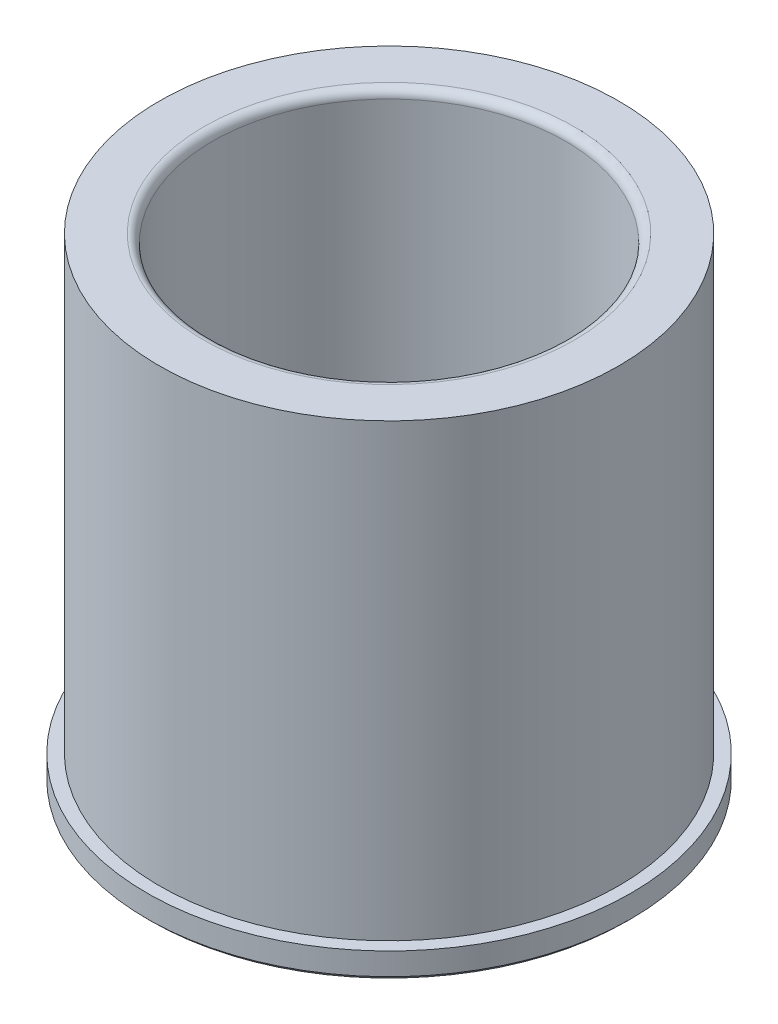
ISO-10303-21;
HEADER;
FILE_DESCRIPTION(('STEP AP214'),'2;1');
FILE_NAME('part.step','',(''),(''),'','','');
FILE_SCHEMA(('AUTOMOTIVE_DESIGN { 1 0 10303 214 1 1 1 1 }'));
ENDSEC;
DATA;
#1=APPLICATION_CONTEXT('core data for automotive mechanical design processes');
#2=APPLICATION_PROTOCOL_DEFINITION('international standard','automotive_design',2000,#1);
#3=PRODUCT_CONTEXT('',#1,'mechanical');
#4=PRODUCT('Part','Part','',(#3));
#5=PRODUCT_RELATED_PRODUCT_CATEGORY('part','',(#4));
#6=PRODUCT_DEFINITION_FORMATION('','',#4);
#7=PRODUCT_DEFINITION_CONTEXT('part definition',#1,'design');
#8=PRODUCT_DEFINITION('design','',#6,#7);
#9=PRODUCT_DEFINITION_SHAPE('','',#8);
#10=(LENGTH_UNIT() NAMED_UNIT(*) SI_UNIT(.MILLI.,.METRE.));
#11=(NAMED_UNIT(*) PLANE_ANGLE_UNIT() SI_UNIT($,.RADIAN.));
#12=(NAMED_UNIT(*) SI_UNIT($,.STERADIAN.) SOLID_ANGLE_UNIT());
#13=UNCERTAINTY_MEASURE_WITH_UNIT(LENGTH_MEASURE(1.E-05),#10,'distance_accuracy_value','');
#14=(GEOMETRIC_REPRESENTATION_CONTEXT(3) GLOBAL_UNCERTAINTY_ASSIGNED_CONTEXT((#13)) GLOBAL_UNIT_ASSIGNED_CONTEXT((#10,
#11,#12)) REPRESENTATION_CONTEXT('',''));
#15=CARTESIAN_POINT('',(0.,0.,0.));
#16=DIRECTION('',(0.,0.,1.));
#17=DIRECTION('',(1.,0.,0.));
#18=AXIS2_PLACEMENT_3D('',#15,#16,#17);
#19=CARTESIAN_POINT('',(3.49148336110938E-12,-1000.,0.));
#20=DIRECTION('',(0.,-1.,0.));
#21=DIRECTION('',(1.,0.,0.));
#22=AXIS2_PLACEMENT_3D('',#19,#20,#21);
#23=CYLINDRICAL_SURFACE('',#22,41.2813499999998);
#24=CARTESIAN_POINT('',(0.,4.76250000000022,0.));
#25=DIRECTION('',(0.,-1.,0.));
#26=DIRECTION('',(1.,0.,0.));
#27=AXIS2_PLACEMENT_3D('',#24,#25,#26);
#28=CIRCLE('',#27,41.28135);
#29=CARTESIAN_POINT('',(41.2813499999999,4.76250000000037,0.));
#30=VERTEX_POINT('',#29);
#31=EDGE_CURVE('E60',#30,#30,#28,.T.);
#32=ORIENTED_EDGE('',*,*,#31,.F.);
#33=EDGE_LOOP('',(#32));
#34=FACE_BOUND('',#33,.T.);
#35=CARTESIAN_POINT('',(-2.99307411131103E-13,85.7250000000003,0.));
#36=DIRECTION('',(0.,-1.,0.));
#37=DIRECTION('',(1.,0.,0.));
#38=AXIS2_PLACEMENT_3D('',#35,#36,#37);
#39=CIRCLE('',#38,41.2813499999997);
#40=CARTESIAN_POINT('',(41.2813499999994,85.7250000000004,0.));
#41=VERTEX_POINT('',#40);
#42=EDGE_CURVE('E39',#41,#41,#39,.T.);
#43=ORIENTED_EDGE('',*,*,#42,.T.);
#44=EDGE_LOOP('',(#43));
#45=FACE_BOUND('',#44,.T.);
#46=ADVANCED_FACE('F28',(#34,#45),#23,.T.);
#47=CARTESIAN_POINT('',(-41.28135,85.725,0.));
#48=DIRECTION('',(0.,-1.,0.));
#49=DIRECTION('',(1.,0.,0.));
#50=AXIS2_PLACEMENT_3D('',#47,#48,#49);
#51=PLANE('',#50);
#52=CARTESIAN_POINT('',(-2.99307411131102E-13,85.7250000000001,0.));
#53=DIRECTION('',(0.,-1.,0.));
#54=DIRECTION('',(1.,0.,0.));
#55=AXIS2_PLACEMENT_3D('',#52,#53,#54);
#56=CIRCLE('',#55,33.2803499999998);
#57=CARTESIAN_POINT('',(33.2803499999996,85.7250000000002,0.));
#58=VERTEX_POINT('',#57);
#59=EDGE_CURVE('E35',#58,#58,#56,.T.);
#60=ORIENTED_EDGE('',*,*,#59,.T.);
#61=EDGE_LOOP('',(#60));
#62=FACE_BOUND('',#61,.T.);
#63=ORIENTED_EDGE('',*,*,#42,.F.);
#64=EDGE_LOOP('',(#63));
#65=FACE_BOUND('',#64,.T.);
#66=ADVANCED_FACE('F68',(#62,#65),#51,.F.);
#67=CARTESIAN_POINT('',(3.49148336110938E-12,-1000.,0.));
#68=DIRECTION('',(0.,-1.,0.));
#69=DIRECTION('',(1.,0.,0.));
#70=AXIS2_PLACEMENT_3D('',#67,#68,#69);
#71=CYLINDRICAL_SURFACE('',#70,31.7563499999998);
#72=CARTESIAN_POINT('',(-2.93986390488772E-13,84.2010000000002,0.));
#73=DIRECTION('',(0.,-1.,0.));
#74=DIRECTION('',(1.,0.,0.));
#75=AXIS2_PLACEMENT_3D('',#72,#73,#74);
#76=CIRCLE('',#75,31.7563499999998);
#77=CARTESIAN_POINT('',(31.7563499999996,84.2010000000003,0.));
#78=VERTEX_POINT('',#77);
#79=EDGE_CURVE('E10',#78,#78,#76,.F.);
#80=ORIENTED_EDGE('',*,*,#79,.T.);
#81=EDGE_LOOP('',(#80));
#82=FACE_BOUND('',#81,.T.);
#83=CARTESIAN_POINT('',(0.,0.761999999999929,0.));
#84=DIRECTION('',(0.,-1.,0.));
#85=DIRECTION('',(1.,0.,0.));
#86=AXIS2_PLACEMENT_3D('',#83,#84,#85);
#87=CIRCLE('',#86,31.75635);
#88=CARTESIAN_POINT('',(31.75635,0.76200000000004,0.));
#89=VERTEX_POINT('',#88);
#90=EDGE_CURVE('E43',#89,#89,#87,.T.);
#91=ORIENTED_EDGE('',*,*,#90,.T.);
#92=EDGE_LOOP('',(#91));
#93=FACE_BOUND('',#92,.T.);
#94=ADVANCED_FACE('F72',(#82,#93),#71,.F.);
#95=CARTESIAN_POINT('',(0.,2.22044604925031E-13,0.));
#96=DIRECTION('',(0.,-1.,0.));
#97=DIRECTION('',(1.,0.,0.));
#98=AXIS2_PLACEMENT_3D('',#95,#96,#97);
#99=CONICAL_SURFACE('',#98,32.51835,0.78539816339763);
#100=ORIENTED_EDGE('',*,*,#90,.F.);
#101=EDGE_LOOP('',(#100));
#102=FACE_BOUND('',#101,.T.);
#103=CARTESIAN_POINT('',(0.,2.22044604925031E-13,0.));
#104=DIRECTION('',(0.,-1.,0.));
#105=DIRECTION('',(1.,0.,0.));
#106=AXIS2_PLACEMENT_3D('',#103,#104,#105);
#107=CIRCLE('',#106,32.51835);
#108=CARTESIAN_POINT('',(32.51835,3.35581882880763E-13,0.));
#109=VERTEX_POINT('',#108);
#110=EDGE_CURVE('E48',#109,#109,#107,.T.);
#111=ORIENTED_EDGE('',*,*,#110,.T.);
#112=EDGE_LOOP('',(#111));
#113=FACE_BOUND('',#112,.T.);
#114=ADVANCED_FACE('F77',(#102,#113),#99,.F.);
#115=CARTESIAN_POINT('',(-32.51835,0.,0.));
#116=DIRECTION('',(0.,1.,0.));
#117=DIRECTION('',(-1.,0.,0.));
#118=AXIS2_PLACEMENT_3D('',#115,#116,#117);
#119=PLANE('',#118);
#120=ORIENTED_EDGE('',*,*,#110,.F.);
#121=EDGE_LOOP('',(#120));
#122=FACE_BOUND('',#121,.T.);
#123=CARTESIAN_POINT('',(0.,2.22044604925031E-13,0.));
#124=DIRECTION('',(0.,-1.,0.));
#125=DIRECTION('',(1.,0.,0.));
#126=AXIS2_PLACEMENT_3D('',#123,#124,#125);
#127=CIRCLE('',#126,42.7609);
#128=CARTESIAN_POINT('',(42.7609,3.71343575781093E-13,0.));
#129=VERTEX_POINT('',#128);
#130=EDGE_CURVE('E51',#129,#129,#127,.T.);
#131=ORIENTED_EDGE('',*,*,#130,.T.);
#132=EDGE_LOOP('',(#131));
#133=FACE_BOUND('',#132,.T.);
#134=ADVANCED_FACE('F82',(#122,#133),#119,.F.);
#135=CARTESIAN_POINT('',(0.,0.762000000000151,0.));
#136=DIRECTION('',(0.,1.,0.));
#137=DIRECTION('',(-1.,0.,0.));
#138=AXIS2_PLACEMENT_3D('',#135,#136,#137);
#139=CONICAL_SURFACE('',#138,43.5229,0.785398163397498);
#140=ORIENTED_EDGE('',*,*,#130,.F.);
#141=EDGE_LOOP('',(#140));
#142=FACE_BOUND('',#141,.T.);
#143=CARTESIAN_POINT('',(0.,0.762000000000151,0.));
#144=DIRECTION('',(0.,-1.,0.));
#145=DIRECTION('',(1.,0.,0.));
#146=AXIS2_PLACEMENT_3D('',#143,#144,#145);
#147=CIRCLE('',#146,43.5229);
#148=CARTESIAN_POINT('',(43.5229,0.762000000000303,0.));
#149=VERTEX_POINT('',#148);
#150=EDGE_CURVE('E54',#149,#149,#147,.T.);
#151=ORIENTED_EDGE('',*,*,#150,.T.);
#152=EDGE_LOOP('',(#151));
#153=FACE_BOUND('',#152,.T.);
#154=ADVANCED_FACE('F86',(#142,#153),#139,.T.);
#155=CARTESIAN_POINT('',(3.49148336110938E-12,-1000.,0.));
#156=DIRECTION('',(0.,-1.,0.));
#157=DIRECTION('',(1.,0.,0.));
#158=AXIS2_PLACEMENT_3D('',#155,#156,#157);
#159=CYLINDRICAL_SURFACE('',#158,43.5229);
#160=ORIENTED_EDGE('',*,*,#150,.F.);
#161=EDGE_LOOP('',(#160));
#162=FACE_BOUND('',#161,.T.);
#163=CARTESIAN_POINT('',(0.,4.76250000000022,0.));
#164=DIRECTION('',(0.,-1.,0.));
#165=DIRECTION('',(1.,0.,0.));
#166=AXIS2_PLACEMENT_3D('',#163,#164,#165);
#167=CIRCLE('',#166,43.5229);
#168=CARTESIAN_POINT('',(43.5229,4.76250000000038,0.));
#169=VERTEX_POINT('',#168);
#170=EDGE_CURVE('E57',#169,#169,#167,.T.);
#171=ORIENTED_EDGE('',*,*,#170,.T.);
#172=EDGE_LOOP('',(#171));
#173=FACE_BOUND('',#172,.T.);
#174=ADVANCED_FACE('F90',(#162,#173),#159,.T.);
#175=CARTESIAN_POINT('',(-43.5229,4.76249999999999,0.));
#176=DIRECTION('',(0.,-1.,0.));
#177=DIRECTION('',(1.,0.,0.));
#178=AXIS2_PLACEMENT_3D('',#175,#176,#177);
#179=PLANE('',#178);
#180=ORIENTED_EDGE('',*,*,#170,.F.);
#181=EDGE_LOOP('',(#180));
#182=FACE_BOUND('',#181,.T.);
#183=ORIENTED_EDGE('',*,*,#31,.T.);
#184=EDGE_LOOP('',(#183));
#185=FACE_BOUND('',#184,.T.);
#186=ADVANCED_FACE('F64',(#182,#185),#179,.F.);
#187=CARTESIAN_POINT('',(-2.93986390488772E-13,84.2010000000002,0.));
#188=DIRECTION('',(0.,-1.,0.));
#189=DIRECTION('',(1.,0.,0.));
#190=AXIS2_PLACEMENT_3D('',#187,#188,#189);
#191=TOROIDAL_SURFACE('',#190,33.2803499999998,1.524);
#192=ORIENTED_EDGE('',*,*,#79,.F.);
#193=EDGE_LOOP('',(#192));
#194=FACE_BOUND('',#193,.T.);
#195=ORIENTED_EDGE('',*,*,#59,.F.);
#196=EDGE_LOOP('',(#195));
#197=FACE_BOUND('',#196,.T.);
#198=ADVANCED_FACE('F30',(#194,#197),#191,.T.);
#199=CLOSED_SHELL('',(#46,#66,#94,#114,#134,#154,#174,#186,#198));
#200=MANIFOLD_SOLID_BREP('B2',#199);
#201=ADVANCED_BREP_SHAPE_REPRESENTATION('',(#18,#200),#14);
#202=SHAPE_DEFINITION_REPRESENTATION(#9,#201);
ENDSEC;
END-ISO-10303-21;
